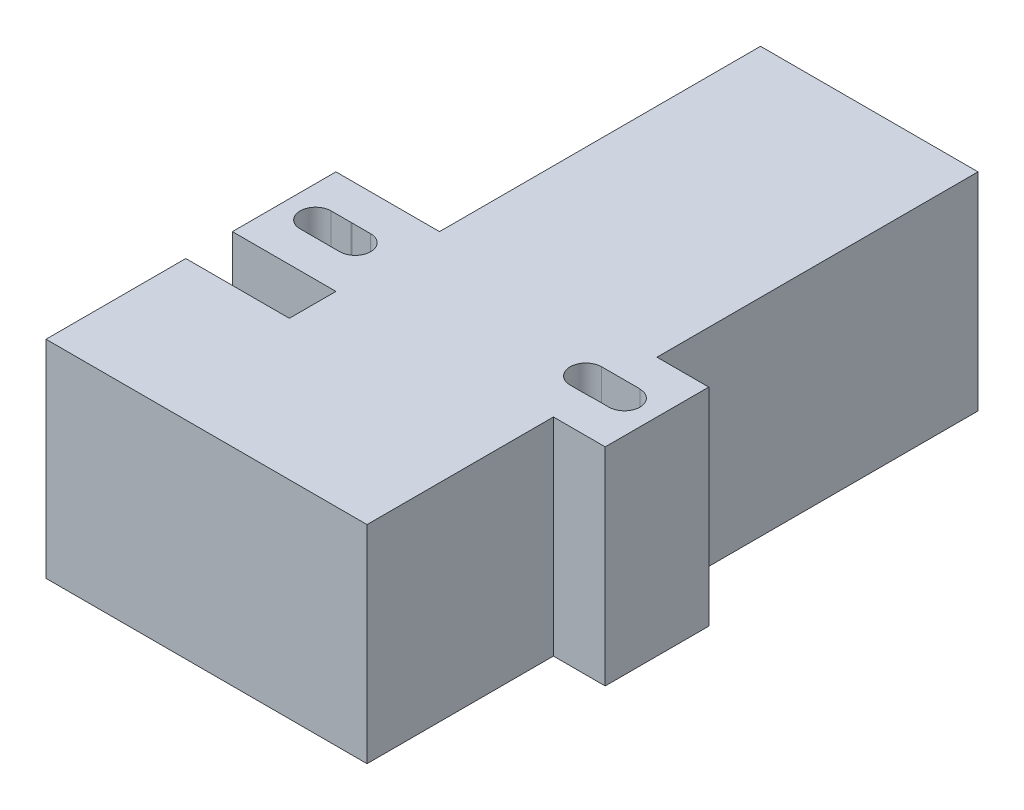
ISO-10303-21;
HEADER;
FILE_DESCRIPTION(('STEP AP214'),'2;1');
FILE_NAME('part.step','',(''),(''),'','','');
FILE_SCHEMA(('AUTOMOTIVE_DESIGN { 1 0 10303 214 1 1 1 1 }'));
ENDSEC;
DATA;
#1=APPLICATION_CONTEXT('core data for automotive mechanical design processes');
#2=APPLICATION_PROTOCOL_DEFINITION('international standard','automotive_design',2000,#1);
#3=PRODUCT_CONTEXT('',#1,'mechanical');
#4=PRODUCT('Part','Part','',(#3));
#5=PRODUCT_RELATED_PRODUCT_CATEGORY('part','',(#4));
#6=PRODUCT_DEFINITION_FORMATION('','',#4);
#7=PRODUCT_DEFINITION_CONTEXT('part definition',#1,'design');
#8=PRODUCT_DEFINITION('design','',#6,#7);
#9=PRODUCT_DEFINITION_SHAPE('','',#8);
#10=(LENGTH_UNIT() NAMED_UNIT(*) SI_UNIT(.MILLI.,.METRE.));
#11=(NAMED_UNIT(*) PLANE_ANGLE_UNIT() SI_UNIT($,.RADIAN.));
#12=(NAMED_UNIT(*) SI_UNIT($,.STERADIAN.) SOLID_ANGLE_UNIT());
#13=UNCERTAINTY_MEASURE_WITH_UNIT(LENGTH_MEASURE(1.E-05),#10,'distance_accuracy_value','');
#14=(GEOMETRIC_REPRESENTATION_CONTEXT(3) GLOBAL_UNCERTAINTY_ASSIGNED_CONTEXT((#13)) GLOBAL_UNIT_ASSIGNED_CONTEXT((#10,
#11,#12)) REPRESENTATION_CONTEXT('',''));
#15=CARTESIAN_POINT('',(0.,0.,0.));
#16=DIRECTION('',(0.,0.,1.));
#17=DIRECTION('',(1.,0.,0.));
#18=AXIS2_PLACEMENT_3D('',#15,#16,#17);
#19=CARTESIAN_POINT('',(0.,20.,0.));
#20=DIRECTION('',(0.,-1.,0.));
#21=DIRECTION('',(0.,0.,-1.));
#22=AXIS2_PLACEMENT_3D('',#19,#20,#21);
#23=PLANE('',#22);
#24=DIRECTION('',(1.,0.,0.));
#25=VECTOR('',#24,1.);
#26=CARTESIAN_POINT('',(0.,20.,-18.));
#27=LINE('',#26,#25);
#28=CARTESIAN_POINT('',(21.,20.,-18.));
#29=VERTEX_POINT('',#28);
#30=CARTESIAN_POINT('',(26.,20.,-18.));
#31=VERTEX_POINT('',#30);
#32=EDGE_CURVE('E257',#29,#31,#27,.T.);
#33=ORIENTED_EDGE('',*,*,#32,.T.);
#34=DIRECTION('',(0.,0.,1.));
#35=VECTOR('',#34,1.);
#36=CARTESIAN_POINT('',(26.,20.,-18.));
#37=LINE('',#36,#35);
#38=CARTESIAN_POINT('',(26.,20.,-28.));
#39=VERTEX_POINT('',#38);
#40=EDGE_CURVE('E465',#39,#31,#37,.T.);
#41=ORIENTED_EDGE('',*,*,#40,.F.);
#42=DIRECTION('',(1.,0.,0.));
#43=VECTOR('',#42,1.);
#44=CARTESIAN_POINT('',(0.,20.,-28.));
#45=LINE('',#44,#43);
#46=CARTESIAN_POINT('',(21.,20.,-28.));
#47=VERTEX_POINT('',#46);
#48=EDGE_CURVE('E418',#47,#39,#45,.T.);
#49=ORIENTED_EDGE('',*,*,#48,.F.);
#50=DIRECTION('',(0.,0.,-1.));
#51=VECTOR('',#50,1.);
#52=CARTESIAN_POINT('',(21.,20.,0.));
#53=LINE('',#52,#51);
#54=CARTESIAN_POINT('',(21.,20.,-59.));
#55=VERTEX_POINT('',#54);
#56=EDGE_CURVE('E406',#47,#55,#53,.T.);
#57=ORIENTED_EDGE('',*,*,#56,.T.);
#58=DIRECTION('',(-1.,0.,0.));
#59=VECTOR('',#58,1.);
#60=CARTESIAN_POINT('',(0.,20.,-59.));
#61=LINE('',#60,#59);
#62=CARTESIAN_POINT('',(0.,20.,-59.));
#63=VERTEX_POINT('',#62);
#64=EDGE_CURVE('E403',#55,#63,#61,.T.);
#65=ORIENTED_EDGE('',*,*,#64,.T.);
#66=DIRECTION('',(0.,0.,1.));
#67=VECTOR('',#66,1.);
#68=CARTESIAN_POINT('',(0.,20.,0.));
#69=LINE('',#68,#67);
#70=CARTESIAN_POINT('',(0.,20.,-28.));
#71=VERTEX_POINT('',#70);
#72=EDGE_CURVE('E405',#63,#71,#69,.T.);
#73=ORIENTED_EDGE('',*,*,#72,.T.);
#74=DIRECTION('',(1.,0.,0.));
#75=VECTOR('',#74,1.);
#76=CARTESIAN_POINT('',(0.,20.,-28.));
#77=LINE('',#76,#75);
#78=CARTESIAN_POINT('',(-10.,20.,-28.));
#79=VERTEX_POINT('',#78);
#80=EDGE_CURVE('E417',#79,#71,#77,.T.);
#81=ORIENTED_EDGE('',*,*,#80,.F.);
#82=DIRECTION('',(0.,0.,1.));
#83=VECTOR('',#82,1.);
#84=CARTESIAN_POINT('',(-10.,20.,-28.));
#85=LINE('',#84,#83);
#86=CARTESIAN_POINT('',(-10.,20.,-18.));
#87=VERTEX_POINT('',#86);
#88=EDGE_CURVE('E413',#79,#87,#85,.T.);
#89=ORIENTED_EDGE('',*,*,#88,.T.);
#90=DIRECTION('',(1.,0.,0.));
#91=VECTOR('',#90,1.);
#92=CARTESIAN_POINT('',(0.,20.,-18.));
#93=LINE('',#92,#91);
#94=CARTESIAN_POINT('',(0.,20.,-18.));
#95=VERTEX_POINT('',#94);
#96=EDGE_CURVE('E434',#87,#95,#93,.T.);
#97=ORIENTED_EDGE('',*,*,#96,.T.);
#98=CARTESIAN_POINT('',(0.,20.,-13.5));
#99=VERTEX_POINT('',#98);
#100=EDGE_CURVE('E414',#95,#99,#69,.T.);
#101=ORIENTED_EDGE('',*,*,#100,.T.);
#102=DIRECTION('',(-1.,0.,0.));
#103=VECTOR('',#102,1.);
#104=CARTESIAN_POINT('',(21.,20.,-13.5));
#105=LINE('',#104,#103);
#106=CARTESIAN_POINT('',(-10.,20.,-13.5));
#107=VERTEX_POINT('',#106);
#108=EDGE_CURVE('E455',#99,#107,#105,.T.);
#109=ORIENTED_EDGE('',*,*,#108,.T.);
#110=DIRECTION('',(0.,0.,1.));
#111=VECTOR('',#110,1.);
#112=CARTESIAN_POINT('',(-10.,20.,0.));
#113=LINE('',#112,#111);
#114=CARTESIAN_POINT('',(-10.,20.,0.));
#115=VERTEX_POINT('',#114);
#116=EDGE_CURVE('E410',#107,#115,#113,.T.);
#117=ORIENTED_EDGE('',*,*,#116,.T.);
#118=DIRECTION('',(1.,0.,0.));
#119=VECTOR('',#118,1.);
#120=CARTESIAN_POINT('',(0.,20.,0.));
#121=LINE('',#120,#119);
#122=CARTESIAN_POINT('',(21.,20.,0.));
#123=VERTEX_POINT('',#122);
#124=EDGE_CURVE('E408',#115,#123,#121,.T.);
#125=ORIENTED_EDGE('',*,*,#124,.T.);
#126=EDGE_CURVE('E333',#123,#29,#53,.T.);
#127=ORIENTED_EDGE('',*,*,#126,.T.);
#128=EDGE_LOOP('',(#33,#41,#49,#57,#65,#73,#81,#89,#97,#101,#109,#117,#125,#127));
#129=FACE_BOUND('',#128,.T.);
#130=CARTESIAN_POINT('',(-3.14042859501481,20.,-23.));
#131=DIRECTION('',(0.,1.,0.));
#132=DIRECTION('',(0.,0.,1.));
#133=AXIS2_PLACEMENT_3D('',#130,#131,#132);
#134=CIRCLE('',#133,1.499718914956);
#135=CARTESIAN_POINT('',(-3.14042859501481,20.,-21.500281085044));
#136=VERTEX_POINT('',#135);
#137=CARTESIAN_POINT('',(-3.14042859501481,20.,-24.499718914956));
#138=VERTEX_POINT('',#137);
#139=EDGE_CURVE('E357',#136,#138,#134,.T.);
#140=ORIENTED_EDGE('',*,*,#139,.F.);
#141=DIRECTION('',(1.,0.,0.));
#142=VECTOR('',#141,1.);
#143=CARTESIAN_POINT('',(-5.,20.,-21.500281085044));
#144=LINE('',#143,#142);
#145=CARTESIAN_POINT('',(-4.97096250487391,20.,-21.500281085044));
#146=VERTEX_POINT('',#145);
#147=EDGE_CURVE('E318',#146,#136,#144,.T.);
#148=ORIENTED_EDGE('',*,*,#147,.F.);
#149=CARTESIAN_POINT('',(-5.,20.,-23.));
#150=DIRECTION('',(0.,1.,0.));
#151=DIRECTION('',(0.,0.,1.));
#152=AXIS2_PLACEMENT_3D('',#149,#150,#151);
#153=CIRCLE('',#152,1.5);
#154=CARTESIAN_POINT('',(-5.0290374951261,20.,-21.500281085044));
#155=VERTEX_POINT('',#154);
#156=EDGE_CURVE('E288',#155,#146,#153,.T.);
#157=ORIENTED_EDGE('',*,*,#156,.F.);
#158=DIRECTION('',(-1.,0.,0.));
#159=VECTOR('',#158,1.);
#160=CARTESIAN_POINT('',(0.,20.,-21.500281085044));
#161=LINE('',#160,#159);
#162=CARTESIAN_POINT('',(-6.96513960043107,20.,-21.500281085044));
#163=VERTEX_POINT('',#162);
#164=EDGE_CURVE('E330',#155,#163,#161,.T.);
#165=ORIENTED_EDGE('',*,*,#164,.T.);
#166=CARTESIAN_POINT('',(-6.96513960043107,20.,-23.));
#167=DIRECTION('',(0.,1.,0.));
#168=DIRECTION('',(0.,0.,1.));
#169=AXIS2_PLACEMENT_3D('',#166,#167,#168);
#170=CIRCLE('',#169,1.499718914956);
#171=CARTESIAN_POINT('',(-6.96513960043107,20.,-24.499718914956));
#172=VERTEX_POINT('',#171);
#173=EDGE_CURVE('E319',#172,#163,#170,.T.);
#174=ORIENTED_EDGE('',*,*,#173,.F.);
#175=DIRECTION('',(-1.,0.,0.));
#176=VECTOR('',#175,1.);
#177=CARTESIAN_POINT('',(0.,20.,-24.499718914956));
#178=LINE('',#177,#176);
#179=CARTESIAN_POINT('',(-5.0290374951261,20.,-24.499718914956));
#180=VERTEX_POINT('',#179);
#181=EDGE_CURVE('E326',#180,#172,#178,.T.);
#182=ORIENTED_EDGE('',*,*,#181,.F.);
#183=CARTESIAN_POINT('',(-4.97096250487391,20.,-24.499718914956));
#184=VERTEX_POINT('',#183);
#185=EDGE_CURVE('E283',#184,#180,#153,.T.);
#186=ORIENTED_EDGE('',*,*,#185,.F.);
#187=DIRECTION('',(1.,0.,0.));
#188=VECTOR('',#187,1.);
#189=CARTESIAN_POINT('',(-5.,20.,-24.499718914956));
#190=LINE('',#189,#188);
#191=EDGE_CURVE('E309',#184,#138,#190,.T.);
#192=ORIENTED_EDGE('',*,*,#191,.T.);
#193=EDGE_LOOP('',(#140,#148,#157,#165,#174,#182,#186,#192));
#194=FACE_BOUND('',#193,.T.);
#195=DIRECTION('',(-1.,0.,0.));
#196=VECTOR('',#195,1.);
#197=CARTESIAN_POINT('',(0.,20.,-24.5264940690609));
#198=LINE('',#197,#196);
#199=CARTESIAN_POINT('',(22.8582460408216,20.,-24.5264940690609));
#200=VERTEX_POINT('',#199);
#201=CARTESIAN_POINT('',(19.1364996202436,20.,-24.5264940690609));
#202=VERTEX_POINT('',#201);
#203=EDGE_CURVE('E297',#200,#202,#198,.T.);
#204=ORIENTED_EDGE('',*,*,#203,.F.);
#205=DIRECTION('',(0.,0.,-1.));
#206=VECTOR('',#205,1.);
#207=CARTESIAN_POINT('',(22.8582460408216,20.,-21.500281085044));
#208=LINE('',#207,#206);
#209=CARTESIAN_POINT('',(22.8582460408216,20.,-24.499718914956));
#210=VERTEX_POINT('',#209);
#211=EDGE_CURVE('E372',#210,#200,#208,.T.);
#212=ORIENTED_EDGE('',*,*,#211,.F.);
#213=CARTESIAN_POINT('',(22.8582460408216,20.,-23.));
#214=DIRECTION('',(0.,1.,0.));
#215=DIRECTION('',(0.,0.,1.));
#216=AXIS2_PLACEMENT_3D('',#213,#214,#215);
#217=CIRCLE('',#216,1.499718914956);
#218=CARTESIAN_POINT('',(22.8582460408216,20.,-21.500281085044));
#219=VERTEX_POINT('',#218);
#220=EDGE_CURVE('E266',#219,#210,#217,.T.);
#221=ORIENTED_EDGE('',*,*,#220,.F.);
#222=DIRECTION('',(1.,0.,0.));
#223=VECTOR('',#222,1.);
#224=CARTESIAN_POINT('',(0.,20.,-21.500281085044));
#225=LINE('',#224,#223);
#226=CARTESIAN_POINT('',(21.284652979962,20.,-21.500281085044));
#227=VERTEX_POINT('',#226);
#228=EDGE_CURVE('E75',#227,#219,#225,.T.);
#229=ORIENTED_EDGE('',*,*,#228,.F.);
#230=CARTESIAN_POINT('',(21.,20.,-23.));
#231=DIRECTION('',(0.,1.,0.));
#232=DIRECTION('',(0.,0.,1.));
#233=AXIS2_PLACEMENT_3D('',#230,#231,#232);
#234=CIRCLE('',#233,1.52649406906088);
#235=CARTESIAN_POINT('',(21.,20.,-21.4735059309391));
#236=VERTEX_POINT('',#235);
#237=EDGE_CURVE('E299',#236,#227,#234,.T.);
#238=ORIENTED_EDGE('',*,*,#237,.F.);
#239=DIRECTION('',(-1.,0.,0.));
#240=VECTOR('',#239,1.);
#241=CARTESIAN_POINT('',(0.,20.,-21.4735059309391));
#242=LINE('',#241,#240);
#243=CARTESIAN_POINT('',(19.1364996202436,20.,-21.4735059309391));
#244=VERTEX_POINT('',#243);
#245=EDGE_CURVE('E305',#236,#244,#242,.T.);
#246=ORIENTED_EDGE('',*,*,#245,.T.);
#247=CARTESIAN_POINT('',(19.1364996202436,20.,-23.));
#248=DIRECTION('',(0.,1.,0.));
#249=DIRECTION('',(0.,0.,1.));
#250=AXIS2_PLACEMENT_3D('',#247,#248,#249);
#251=CIRCLE('',#250,1.52649406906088);
#252=EDGE_CURVE('E301',#202,#244,#251,.T.);
#253=ORIENTED_EDGE('',*,*,#252,.F.);
#254=EDGE_LOOP('',(#204,#212,#221,#229,#238,#246,#253));
#255=FACE_BOUND('',#254,.T.);
#256=ADVANCED_FACE('F67',(#129,#194,#255),#23,.F.);
#257=CARTESIAN_POINT('',(0.,0.,0.));
#258=DIRECTION('',(0.,-1.,0.));
#259=DIRECTION('',(0.,0.,-1.));
#260=AXIS2_PLACEMENT_3D('',#257,#258,#259);
#261=PLANE('',#260);
#262=DIRECTION('',(0.,0.,1.));
#263=VECTOR('',#262,1.);
#264=CARTESIAN_POINT('',(22.8582460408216,0.,0.));
#265=LINE('',#264,#263);
#266=CARTESIAN_POINT('',(22.8582460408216,0.,-24.5264940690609));
#267=VERTEX_POINT('',#266);
#268=CARTESIAN_POINT('',(22.8582460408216,0.,-24.499718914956));
#269=VERTEX_POINT('',#268);
#270=EDGE_CURVE('E246',#267,#269,#265,.T.);
#271=ORIENTED_EDGE('',*,*,#270,.F.);
#272=DIRECTION('',(-1.,0.,0.));
#273=VECTOR('',#272,1.);
#274=CARTESIAN_POINT('',(0.,0.,-24.5264940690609));
#275=LINE('',#274,#273);
#276=CARTESIAN_POINT('',(19.1364996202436,0.,-24.5264940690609));
#277=VERTEX_POINT('',#276);
#278=EDGE_CURVE('E273',#267,#277,#275,.T.);
#279=ORIENTED_EDGE('',*,*,#278,.T.);
#280=CARTESIAN_POINT('',(19.1364996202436,0.,-23.));
#281=DIRECTION('',(0.,1.,0.));
#282=DIRECTION('',(0.,0.,1.));
#283=AXIS2_PLACEMENT_3D('',#280,#281,#282);
#284=CIRCLE('',#283,1.52649406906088);
#285=CARTESIAN_POINT('',(19.1364996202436,0.,-21.4735059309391));
#286=VERTEX_POINT('',#285);
#287=EDGE_CURVE('E276',#277,#286,#284,.T.);
#288=ORIENTED_EDGE('',*,*,#287,.T.);
#289=DIRECTION('',(-1.,0.,0.));
#290=VECTOR('',#289,1.);
#291=CARTESIAN_POINT('',(0.,0.,-21.4735059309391));
#292=LINE('',#291,#290);
#293=CARTESIAN_POINT('',(21.,0.,-21.4735059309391));
#294=VERTEX_POINT('',#293);
#295=EDGE_CURVE('E296',#294,#286,#292,.T.);
#296=ORIENTED_EDGE('',*,*,#295,.F.);
#297=CARTESIAN_POINT('',(21.,0.,-23.));
#298=DIRECTION('',(0.,1.,0.));
#299=DIRECTION('',(0.,0.,1.));
#300=AXIS2_PLACEMENT_3D('',#297,#298,#299);
#301=CIRCLE('',#300,1.52649406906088);
#302=CARTESIAN_POINT('',(21.284652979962,0.,-21.500281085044));
#303=VERTEX_POINT('',#302);
#304=EDGE_CURVE('E284',#294,#303,#301,.T.);
#305=ORIENTED_EDGE('',*,*,#304,.T.);
#306=DIRECTION('',(1.,0.,0.));
#307=VECTOR('',#306,1.);
#308=CARTESIAN_POINT('',(0.,0.,-21.500281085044));
#309=LINE('',#308,#307);
#310=CARTESIAN_POINT('',(22.8582460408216,0.,-21.500281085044));
#311=VERTEX_POINT('',#310);
#312=EDGE_CURVE('E272',#303,#311,#309,.T.);
#313=ORIENTED_EDGE('',*,*,#312,.T.);
#314=CARTESIAN_POINT('',(22.8582460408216,0.,-23.));
#315=DIRECTION('',(0.,1.,0.));
#316=DIRECTION('',(0.,0.,1.));
#317=AXIS2_PLACEMENT_3D('',#314,#315,#316);
#318=CIRCLE('',#317,1.499718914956);
#319=EDGE_CURVE('E263',#311,#269,#318,.T.);
#320=ORIENTED_EDGE('',*,*,#319,.T.);
#321=EDGE_LOOP('',(#271,#279,#288,#296,#305,#313,#320));
#322=FACE_BOUND('',#321,.T.);
#323=DIRECTION('',(1.,0.,0.));
#324=VECTOR('',#323,1.);
#325=CARTESIAN_POINT('',(-5.,0.,-21.500281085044));
#326=LINE('',#325,#324);
#327=CARTESIAN_POINT('',(-4.97096250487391,0.,-21.500281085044));
#328=VERTEX_POINT('',#327);
#329=CARTESIAN_POINT('',(-3.14042859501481,0.,-21.500281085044));
#330=VERTEX_POINT('',#329);
#331=EDGE_CURVE('E308',#328,#330,#326,.T.);
#332=ORIENTED_EDGE('',*,*,#331,.T.);
#333=CARTESIAN_POINT('',(-3.14042859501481,0.,-23.));
#334=DIRECTION('',(0.,1.,0.));
#335=DIRECTION('',(0.,0.,1.));
#336=AXIS2_PLACEMENT_3D('',#333,#334,#335);
#337=CIRCLE('',#336,1.499718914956);
#338=CARTESIAN_POINT('',(-3.14042859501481,0.,-24.499718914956));
#339=VERTEX_POINT('',#338);
#340=EDGE_CURVE('E349',#330,#339,#337,.T.);
#341=ORIENTED_EDGE('',*,*,#340,.T.);
#342=DIRECTION('',(1.,0.,0.));
#343=VECTOR('',#342,1.);
#344=CARTESIAN_POINT('',(-5.,0.,-24.499718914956));
#345=LINE('',#344,#343);
#346=CARTESIAN_POINT('',(-4.97096250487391,0.,-24.499718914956));
#347=VERTEX_POINT('',#346);
#348=EDGE_CURVE('E352',#347,#339,#345,.T.);
#349=ORIENTED_EDGE('',*,*,#348,.F.);
#350=CARTESIAN_POINT('',(-5.,0.,-23.));
#351=DIRECTION('',(0.,1.,0.));
#352=DIRECTION('',(0.,0.,1.));
#353=AXIS2_PLACEMENT_3D('',#350,#351,#352);
#354=CIRCLE('',#353,1.5);
#355=CARTESIAN_POINT('',(-5.0290374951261,0.,-24.499718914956));
#356=VERTEX_POINT('',#355);
#357=EDGE_CURVE('E346',#347,#356,#354,.T.);
#358=ORIENTED_EDGE('',*,*,#357,.T.);
#359=DIRECTION('',(-1.,0.,0.));
#360=VECTOR('',#359,1.);
#361=CARTESIAN_POINT('',(0.,0.,-24.499718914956));
#362=LINE('',#361,#360);
#363=CARTESIAN_POINT('',(-6.96513960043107,0.,-24.499718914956));
#364=VERTEX_POINT('',#363);
#365=EDGE_CURVE('E343',#356,#364,#362,.T.);
#366=ORIENTED_EDGE('',*,*,#365,.T.);
#367=CARTESIAN_POINT('',(-6.96513960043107,0.,-23.));
#368=DIRECTION('',(0.,1.,0.));
#369=DIRECTION('',(0.,0.,1.));
#370=AXIS2_PLACEMENT_3D('',#367,#368,#369);
#371=CIRCLE('',#370,1.499718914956);
#372=CARTESIAN_POINT('',(-6.96513960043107,0.,-21.500281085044));
#373=VERTEX_POINT('',#372);
#374=EDGE_CURVE('E339',#364,#373,#371,.T.);
#375=ORIENTED_EDGE('',*,*,#374,.T.);
#376=DIRECTION('',(-1.,0.,0.));
#377=VECTOR('',#376,1.);
#378=CARTESIAN_POINT('',(0.,0.,-21.500281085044));
#379=LINE('',#378,#377);
#380=CARTESIAN_POINT('',(-5.0290374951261,0.,-21.500281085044));
#381=VERTEX_POINT('',#380);
#382=EDGE_CURVE('E322',#381,#373,#379,.T.);
#383=ORIENTED_EDGE('',*,*,#382,.F.);
#384=EDGE_CURVE('E342',#381,#328,#354,.T.);
#385=ORIENTED_EDGE('',*,*,#384,.T.);
#386=EDGE_LOOP('',(#332,#341,#349,#358,#366,#375,#383,#385));
#387=FACE_BOUND('',#386,.T.);
#388=DIRECTION('',(0.,0.,1.));
#389=VECTOR('',#388,1.);
#390=CARTESIAN_POINT('',(26.,0.,-18.));
#391=LINE('',#390,#389);
#392=CARTESIAN_POINT('',(26.,0.,-28.));
#393=VERTEX_POINT('',#392);
#394=CARTESIAN_POINT('',(26.,0.,-18.));
#395=VERTEX_POINT('',#394);
#396=EDGE_CURVE('E441',#393,#395,#391,.T.);
#397=ORIENTED_EDGE('',*,*,#396,.T.);
#398=DIRECTION('',(1.,0.,0.));
#399=VECTOR('',#398,1.);
#400=CARTESIAN_POINT('',(0.,0.,-18.));
#401=LINE('',#400,#399);
#402=CARTESIAN_POINT('',(21.,0.,-18.));
#403=VERTEX_POINT('',#402);
#404=EDGE_CURVE('E423',#403,#395,#401,.T.);
#405=ORIENTED_EDGE('',*,*,#404,.F.);
#406=DIRECTION('',(0.,0.,-1.));
#407=VECTOR('',#406,1.);
#408=CARTESIAN_POINT('',(21.,0.,0.));
#409=LINE('',#408,#407);
#410=CARTESIAN_POINT('',(21.,0.,0.));
#411=VERTEX_POINT('',#410);
#412=EDGE_CURVE('E384',#411,#403,#409,.T.);
#413=ORIENTED_EDGE('',*,*,#412,.F.);
#414=DIRECTION('',(1.,0.,0.));
#415=VECTOR('',#414,1.);
#416=CARTESIAN_POINT('',(0.,0.,0.));
#417=LINE('',#416,#415);
#418=CARTESIAN_POINT('',(-10.,0.,0.));
#419=VERTEX_POINT('',#418);
#420=EDGE_CURVE('E394',#419,#411,#417,.T.);
#421=ORIENTED_EDGE('',*,*,#420,.F.);
#422=DIRECTION('',(0.,0.,1.));
#423=VECTOR('',#422,1.);
#424=CARTESIAN_POINT('',(-10.,0.,0.));
#425=LINE('',#424,#423);
#426=CARTESIAN_POINT('',(-10.,0.,-13.5));
#427=VERTEX_POINT('',#426);
#428=EDGE_CURVE('E448',#427,#419,#425,.T.);
#429=ORIENTED_EDGE('',*,*,#428,.F.);
#430=DIRECTION('',(-1.,0.,0.));
#431=VECTOR('',#430,1.);
#432=CARTESIAN_POINT('',(21.,0.,-13.5));
#433=LINE('',#432,#431);
#434=CARTESIAN_POINT('',(0.,0.,-13.5));
#435=VERTEX_POINT('',#434);
#436=EDGE_CURVE('E430',#435,#427,#433,.T.);
#437=ORIENTED_EDGE('',*,*,#436,.F.);
#438=DIRECTION('',(0.,0.,1.));
#439=VECTOR('',#438,1.);
#440=CARTESIAN_POINT('',(0.,0.,0.));
#441=LINE('',#440,#439);
#442=CARTESIAN_POINT('',(0.,0.,-18.));
#443=VERTEX_POINT('',#442);
#444=EDGE_CURVE('E286',#443,#435,#441,.T.);
#445=ORIENTED_EDGE('',*,*,#444,.F.);
#446=DIRECTION('',(1.,0.,0.));
#447=VECTOR('',#446,1.);
#448=CARTESIAN_POINT('',(0.,0.,-18.));
#449=LINE('',#448,#447);
#450=CARTESIAN_POINT('',(-10.,0.,-18.));
#451=VERTEX_POINT('',#450);
#452=EDGE_CURVE('E431',#451,#443,#449,.T.);
#453=ORIENTED_EDGE('',*,*,#452,.F.);
#454=DIRECTION('',(0.,0.,1.));
#455=VECTOR('',#454,1.);
#456=CARTESIAN_POINT('',(-10.,0.,-28.));
#457=LINE('',#456,#455);
#458=CARTESIAN_POINT('',(-10.,0.,-28.));
#459=VERTEX_POINT('',#458);
#460=EDGE_CURVE('E452',#459,#451,#457,.T.);
#461=ORIENTED_EDGE('',*,*,#460,.F.);
#462=DIRECTION('',(1.,0.,0.));
#463=VECTOR('',#462,1.);
#464=CARTESIAN_POINT('',(0.,0.,-28.));
#465=LINE('',#464,#463);
#466=CARTESIAN_POINT('',(0.,0.,-28.));
#467=VERTEX_POINT('',#466);
#468=EDGE_CURVE('E279',#459,#467,#465,.T.);
#469=ORIENTED_EDGE('',*,*,#468,.T.);
#470=CARTESIAN_POINT('',(0.,0.,-59.));
#471=VERTEX_POINT('',#470);
#472=EDGE_CURVE('E400',#471,#467,#441,.T.);
#473=ORIENTED_EDGE('',*,*,#472,.F.);
#474=DIRECTION('',(-1.,0.,0.));
#475=VECTOR('',#474,1.);
#476=CARTESIAN_POINT('',(0.,0.,-59.));
#477=LINE('',#476,#475);
#478=CARTESIAN_POINT('',(21.,0.,-59.));
#479=VERTEX_POINT('',#478);
#480=EDGE_CURVE('E390',#479,#471,#477,.T.);
#481=ORIENTED_EDGE('',*,*,#480,.F.);
#482=CARTESIAN_POINT('',(21.,0.,-28.));
#483=VERTEX_POINT('',#482);
#484=EDGE_CURVE('E398',#483,#479,#409,.T.);
#485=ORIENTED_EDGE('',*,*,#484,.F.);
#486=DIRECTION('',(1.,0.,0.));
#487=VECTOR('',#486,1.);
#488=CARTESIAN_POINT('',(0.,0.,-28.));
#489=LINE('',#488,#487);
#490=EDGE_CURVE('E274',#483,#393,#489,.T.);
#491=ORIENTED_EDGE('',*,*,#490,.T.);
#492=EDGE_LOOP('',(#397,#405,#413,#421,#429,#437,#445,#453,#461,#469,#473,#481,#485,#491));
#493=FACE_BOUND('',#492,.T.);
#494=ADVANCED_FACE('F269',(#322,#387,#493),#261,.T.);
#495=CARTESIAN_POINT('',(-5.,0.,-23.));
#496=DIRECTION('',(0.,1.,0.));
#497=DIRECTION('',(0.,0.,1.));
#498=AXIS2_PLACEMENT_3D('',#495,#496,#497);
#499=CYLINDRICAL_SURFACE('',#498,1.5);
#500=DIRECTION('',(0.,1.,0.));
#501=VECTOR('',#500,1.);
#502=CARTESIAN_POINT('',(-4.97096250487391,0.,-24.499718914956));
#503=LINE('',#502,#501);
#504=EDGE_CURVE('E355',#184,#347,#503,.F.);
#505=ORIENTED_EDGE('',*,*,#504,.F.);
#506=ORIENTED_EDGE('',*,*,#185,.T.);
#507=DIRECTION('',(0.,1.,0.));
#508=VECTOR('',#507,1.);
#509=CARTESIAN_POINT('',(-5.0290374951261,0.,-24.499718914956));
#510=LINE('',#509,#508);
#511=EDGE_CURVE('E328',#356,#180,#510,.T.);
#512=ORIENTED_EDGE('',*,*,#511,.F.);
#513=ORIENTED_EDGE('',*,*,#357,.F.);
#514=EDGE_LOOP('',(#505,#506,#512,#513));
#515=FACE_BOUND('',#514,.T.);
#516=ADVANCED_FACE('F488',(#515),#499,.F.);
#517=CARTESIAN_POINT('',(0.,20.,0.));
#518=DIRECTION('',(1.,0.,0.));
#519=DIRECTION('',(0.,0.,-1.));
#520=AXIS2_PLACEMENT_3D('',#517,#518,#519);
#521=PLANE('',#520);
#522=ORIENTED_EDGE('',*,*,#444,.T.);
#523=DIRECTION('',(0.,1.,0.));
#524=VECTOR('',#523,1.);
#525=CARTESIAN_POINT('',(0.,20.,-13.5));
#526=LINE('',#525,#524);
#527=EDGE_CURVE('E442',#435,#99,#526,.T.);
#528=ORIENTED_EDGE('',*,*,#527,.T.);
#529=ORIENTED_EDGE('',*,*,#100,.F.);
#530=DIRECTION('',(0.,1.,0.));
#531=VECTOR('',#530,1.);
#532=CARTESIAN_POINT('',(0.,0.,-18.));
#533=LINE('',#532,#531);
#534=EDGE_CURVE('E428',#443,#95,#533,.T.);
#535=ORIENTED_EDGE('',*,*,#534,.F.);
#536=EDGE_LOOP('',(#522,#528,#529,#535));
#537=FACE_BOUND('',#536,.T.);
#538=ADVANCED_FACE('F579',(#537),#521,.F.);
#539=CARTESIAN_POINT('',(21.,20.,0.));
#540=DIRECTION('',(-1.,0.,0.));
#541=DIRECTION('',(0.,0.,1.));
#542=AXIS2_PLACEMENT_3D('',#539,#540,#541);
#543=PLANE('',#542);
#544=DIRECTION('',(0.,1.,0.));
#545=VECTOR('',#544,1.);
#546=CARTESIAN_POINT('',(21.,0.,-28.));
#547=LINE('',#546,#545);
#548=EDGE_CURVE('E415',#483,#47,#547,.T.);
#549=ORIENTED_EDGE('',*,*,#548,.F.);
#550=ORIENTED_EDGE('',*,*,#484,.T.);
#551=DIRECTION('',(0.,-1.,0.));
#552=VECTOR('',#551,1.);
#553=CARTESIAN_POINT('',(21.,20.,-59.));
#554=LINE('',#553,#552);
#555=EDGE_CURVE('E386',#55,#479,#554,.T.);
#556=ORIENTED_EDGE('',*,*,#555,.F.);
#557=ORIENTED_EDGE('',*,*,#56,.F.);
#558=EDGE_LOOP('',(#549,#550,#556,#557));
#559=FACE_BOUND('',#558,.T.);
#560=ADVANCED_FACE('F554',(#559),#543,.F.);
#561=ORIENTED_EDGE('',*,*,#472,.T.);
#562=DIRECTION('',(0.,1.,0.));
#563=VECTOR('',#562,1.);
#564=CARTESIAN_POINT('',(0.,0.,-28.));
#565=LINE('',#564,#563);
#566=EDGE_CURVE('E395',#467,#71,#565,.T.);
#567=ORIENTED_EDGE('',*,*,#566,.T.);
#568=ORIENTED_EDGE('',*,*,#72,.F.);
#569=DIRECTION('',(0.,-1.,0.));
#570=VECTOR('',#569,1.);
#571=CARTESIAN_POINT('',(0.,20.,-59.));
#572=LINE('',#571,#570);
#573=EDGE_CURVE('E391',#63,#471,#572,.T.);
#574=ORIENTED_EDGE('',*,*,#573,.T.);
#575=EDGE_LOOP('',(#561,#567,#568,#574));
#576=FACE_BOUND('',#575,.T.);
#577=ADVANCED_FACE('F562',(#576),#521,.F.);
#578=CARTESIAN_POINT('',(0.,20.,0.));
#579=DIRECTION('',(0.,0.,-1.));
#580=DIRECTION('',(-1.,0.,0.));
#581=AXIS2_PLACEMENT_3D('',#578,#579,#580);
#582=PLANE('',#581);
#583=ORIENTED_EDGE('',*,*,#420,.T.);
#584=DIRECTION('',(0.,-1.,0.));
#585=VECTOR('',#584,1.);
#586=CARTESIAN_POINT('',(21.,20.,0.));
#587=LINE('',#586,#585);
#588=EDGE_CURVE('E381',#123,#411,#587,.T.);
#589=ORIENTED_EDGE('',*,*,#588,.F.);
#590=ORIENTED_EDGE('',*,*,#124,.F.);
#591=DIRECTION('',(0.,1.,0.));
#592=VECTOR('',#591,1.);
#593=CARTESIAN_POINT('',(-10.,0.,0.));
#594=LINE('',#593,#592);
#595=EDGE_CURVE('E449',#419,#115,#594,.T.);
#596=ORIENTED_EDGE('',*,*,#595,.F.);
#597=EDGE_LOOP('',(#583,#589,#590,#596));
#598=FACE_BOUND('',#597,.T.);
#599=ADVANCED_FACE('F589',(#598),#582,.F.);
#600=DIRECTION('',(0.,1.,0.));
#601=VECTOR('',#600,1.);
#602=CARTESIAN_POINT('',(21.,0.,-18.));
#603=LINE('',#602,#601);
#604=EDGE_CURVE('E385',#403,#29,#603,.T.);
#605=ORIENTED_EDGE('',*,*,#604,.T.);
#606=ORIENTED_EDGE('',*,*,#126,.F.);
#607=ORIENTED_EDGE('',*,*,#588,.T.);
#608=ORIENTED_EDGE('',*,*,#412,.T.);
#609=EDGE_LOOP('',(#605,#606,#607,#608));
#610=FACE_BOUND('',#609,.T.);
#611=ADVANCED_FACE('F539',(#610),#543,.F.);
#612=CARTESIAN_POINT('',(0.,20.,-59.));
#613=DIRECTION('',(0.,0.,1.));
#614=DIRECTION('',(1.,0.,0.));
#615=AXIS2_PLACEMENT_3D('',#612,#613,#614);
#616=PLANE('',#615);
#617=ORIENTED_EDGE('',*,*,#480,.T.);
#618=ORIENTED_EDGE('',*,*,#573,.F.);
#619=ORIENTED_EDGE('',*,*,#64,.F.);
#620=ORIENTED_EDGE('',*,*,#555,.T.);
#621=EDGE_LOOP('',(#617,#618,#619,#620));
#622=FACE_BOUND('',#621,.T.);
#623=ADVANCED_FACE('F559',(#622),#616,.F.);
#624=CARTESIAN_POINT('',(0.,0.,-18.));
#625=DIRECTION('',(0.,0.,1.));
#626=DIRECTION('',(1.,0.,0.));
#627=AXIS2_PLACEMENT_3D('',#624,#625,#626);
#628=PLANE('',#627);
#629=DIRECTION('',(0.,1.,0.));
#630=VECTOR('',#629,1.);
#631=CARTESIAN_POINT('',(26.,0.,-18.));
#632=LINE('',#631,#630);
#633=EDGE_CURVE('E389',#395,#31,#632,.T.);
#634=ORIENTED_EDGE('',*,*,#633,.T.);
#635=ORIENTED_EDGE('',*,*,#32,.F.);
#636=ORIENTED_EDGE('',*,*,#604,.F.);
#637=ORIENTED_EDGE('',*,*,#404,.T.);
#638=EDGE_LOOP('',(#634,#635,#636,#637));
#639=FACE_BOUND('',#638,.T.);
#640=ADVANCED_FACE('F536',(#639),#628,.T.);
#641=CARTESIAN_POINT('',(0.,0.,-28.));
#642=DIRECTION('',(0.,0.,1.));
#643=DIRECTION('',(1.,0.,0.));
#644=AXIS2_PLACEMENT_3D('',#641,#642,#643);
#645=PLANE('',#644);
#646=ORIENTED_EDGE('',*,*,#48,.T.);
#647=DIRECTION('',(0.,1.,0.));
#648=VECTOR('',#647,1.);
#649=CARTESIAN_POINT('',(26.,0.,-28.));
#650=LINE('',#649,#648);
#651=EDGE_CURVE('E470',#393,#39,#650,.T.);
#652=ORIENTED_EDGE('',*,*,#651,.F.);
#653=ORIENTED_EDGE('',*,*,#490,.F.);
#654=ORIENTED_EDGE('',*,*,#548,.T.);
#655=EDGE_LOOP('',(#646,#652,#653,#654));
#656=FACE_BOUND('',#655,.T.);
#657=ADVANCED_FACE('F549',(#656),#645,.F.);
#658=CARTESIAN_POINT('',(0.,0.,-28.));
#659=DIRECTION('',(0.,0.,1.));
#660=DIRECTION('',(1.,0.,0.));
#661=AXIS2_PLACEMENT_3D('',#658,#659,#660);
#662=PLANE('',#661);
#663=ORIENTED_EDGE('',*,*,#80,.T.);
#664=ORIENTED_EDGE('',*,*,#566,.F.);
#665=ORIENTED_EDGE('',*,*,#468,.F.);
#666=DIRECTION('',(0.,1.,0.));
#667=VECTOR('',#666,1.);
#668=CARTESIAN_POINT('',(-10.,0.,-28.));
#669=LINE('',#668,#667);
#670=EDGE_CURVE('E438',#459,#79,#669,.T.);
#671=ORIENTED_EDGE('',*,*,#670,.T.);
#672=EDGE_LOOP('',(#663,#664,#665,#671));
#673=FACE_BOUND('',#672,.T.);
#674=ADVANCED_FACE('F566',(#673),#662,.F.);
#675=CARTESIAN_POINT('',(0.,0.,-18.));
#676=DIRECTION('',(0.,0.,1.));
#677=DIRECTION('',(1.,0.,0.));
#678=AXIS2_PLACEMENT_3D('',#675,#676,#677);
#679=PLANE('',#678);
#680=ORIENTED_EDGE('',*,*,#96,.F.);
#681=DIRECTION('',(0.,1.,0.));
#682=VECTOR('',#681,1.);
#683=CARTESIAN_POINT('',(-10.,0.,-18.));
#684=LINE('',#683,#682);
#685=EDGE_CURVE('E462',#451,#87,#684,.T.);
#686=ORIENTED_EDGE('',*,*,#685,.F.);
#687=ORIENTED_EDGE('',*,*,#452,.T.);
#688=ORIENTED_EDGE('',*,*,#534,.T.);
#689=EDGE_LOOP('',(#680,#686,#687,#688));
#690=FACE_BOUND('',#689,.T.);
#691=ADVANCED_FACE('F608',(#690),#679,.T.);
#692=CARTESIAN_POINT('',(21.,0.,-13.5));
#693=DIRECTION('',(0.,0.,-1.));
#694=DIRECTION('',(-1.,0.,0.));
#695=AXIS2_PLACEMENT_3D('',#692,#693,#694);
#696=PLANE('',#695);
#697=ORIENTED_EDGE('',*,*,#527,.F.);
#698=ORIENTED_EDGE('',*,*,#436,.T.);
#699=DIRECTION('',(0.,1.,0.));
#700=VECTOR('',#699,1.);
#701=CARTESIAN_POINT('',(-10.,0.,-13.5));
#702=LINE('',#701,#700);
#703=EDGE_CURVE('E445',#427,#107,#702,.T.);
#704=ORIENTED_EDGE('',*,*,#703,.T.);
#705=ORIENTED_EDGE('',*,*,#108,.F.);
#706=EDGE_LOOP('',(#697,#698,#704,#705));
#707=FACE_BOUND('',#706,.T.);
#708=ADVANCED_FACE('F583',(#707),#696,.T.);
#709=CARTESIAN_POINT('',(-10.,0.,0.));
#710=DIRECTION('',(-1.,0.,0.));
#711=DIRECTION('',(0.,0.,1.));
#712=AXIS2_PLACEMENT_3D('',#709,#710,#711);
#713=PLANE('',#712);
#714=ORIENTED_EDGE('',*,*,#116,.F.);
#715=ORIENTED_EDGE('',*,*,#703,.F.);
#716=ORIENTED_EDGE('',*,*,#428,.T.);
#717=ORIENTED_EDGE('',*,*,#595,.T.);
#718=EDGE_LOOP('',(#714,#715,#716,#717));
#719=FACE_BOUND('',#718,.T.);
#720=ADVANCED_FACE('F587',(#719),#713,.T.);
#721=CARTESIAN_POINT('',(-10.,0.,-28.));
#722=DIRECTION('',(-1.,0.,0.));
#723=DIRECTION('',(0.,0.,1.));
#724=AXIS2_PLACEMENT_3D('',#721,#722,#723);
#725=PLANE('',#724);
#726=ORIENTED_EDGE('',*,*,#88,.F.);
#727=ORIENTED_EDGE('',*,*,#670,.F.);
#728=ORIENTED_EDGE('',*,*,#460,.T.);
#729=ORIENTED_EDGE('',*,*,#685,.T.);
#730=EDGE_LOOP('',(#726,#727,#728,#729));
#731=FACE_BOUND('',#730,.T.);
#732=ADVANCED_FACE('F571',(#731),#725,.T.);
#733=CARTESIAN_POINT('',(26.,0.,-18.));
#734=DIRECTION('',(-1.,0.,0.));
#735=DIRECTION('',(0.,0.,1.));
#736=AXIS2_PLACEMENT_3D('',#733,#734,#735);
#737=PLANE('',#736);
#738=ORIENTED_EDGE('',*,*,#40,.T.);
#739=ORIENTED_EDGE('',*,*,#633,.F.);
#740=ORIENTED_EDGE('',*,*,#396,.F.);
#741=ORIENTED_EDGE('',*,*,#651,.T.);
#742=EDGE_LOOP('',(#738,#739,#740,#741));
#743=FACE_BOUND('',#742,.T.);
#744=ADVANCED_FACE('F547',(#743),#737,.F.);
#745=ORIENTED_EDGE('',*,*,#156,.T.);
#746=DIRECTION('',(0.,1.,0.));
#747=VECTOR('',#746,1.);
#748=CARTESIAN_POINT('',(-4.97096250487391,0.,-21.500281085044));
#749=LINE('',#748,#747);
#750=EDGE_CURVE('E327',#146,#328,#749,.F.);
#751=ORIENTED_EDGE('',*,*,#750,.T.);
#752=ORIENTED_EDGE('',*,*,#384,.F.);
#753=DIRECTION('',(0.,1.,0.));
#754=VECTOR('',#753,1.);
#755=CARTESIAN_POINT('',(-5.0290374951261,0.,-21.500281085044));
#756=LINE('',#755,#754);
#757=EDGE_CURVE('E323',#381,#155,#756,.T.);
#758=ORIENTED_EDGE('',*,*,#757,.T.);
#759=EDGE_LOOP('',(#745,#751,#752,#758));
#760=FACE_BOUND('',#759,.T.);
#761=ADVANCED_FACE('F503',(#760),#499,.F.);
#762=CARTESIAN_POINT('',(0.,0.,-24.499718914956));
#763=DIRECTION('',(0.,0.,-1.));
#764=DIRECTION('',(-1.,0.,0.));
#765=AXIS2_PLACEMENT_3D('',#762,#763,#764);
#766=PLANE('',#765);
#767=ORIENTED_EDGE('',*,*,#181,.T.);
#768=DIRECTION('',(0.,1.,0.));
#769=VECTOR('',#768,1.);
#770=CARTESIAN_POINT('',(-6.96513960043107,0.,-24.499718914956));
#771=LINE('',#770,#769);
#772=EDGE_CURVE('E316',#364,#172,#771,.T.);
#773=ORIENTED_EDGE('',*,*,#772,.F.);
#774=ORIENTED_EDGE('',*,*,#365,.F.);
#775=ORIENTED_EDGE('',*,*,#511,.T.);
#776=EDGE_LOOP('',(#767,#773,#774,#775));
#777=FACE_BOUND('',#776,.T.);
#778=ADVANCED_FACE('F492',(#777),#766,.F.);
#779=CARTESIAN_POINT('',(0.,0.,-21.500281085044));
#780=DIRECTION('',(0.,0.,-1.));
#781=DIRECTION('',(-1.,0.,0.));
#782=AXIS2_PLACEMENT_3D('',#779,#780,#781);
#783=PLANE('',#782);
#784=ORIENTED_EDGE('',*,*,#164,.F.);
#785=ORIENTED_EDGE('',*,*,#757,.F.);
#786=ORIENTED_EDGE('',*,*,#382,.T.);
#787=DIRECTION('',(0.,1.,0.));
#788=VECTOR('',#787,1.);
#789=CARTESIAN_POINT('',(-6.96513960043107,0.,-21.500281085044));
#790=LINE('',#789,#788);
#791=EDGE_CURVE('E320',#373,#163,#790,.T.);
#792=ORIENTED_EDGE('',*,*,#791,.T.);
#793=EDGE_LOOP('',(#784,#785,#786,#792));
#794=FACE_BOUND('',#793,.T.);
#795=ADVANCED_FACE('F637',(#794),#783,.T.);
#796=CARTESIAN_POINT('',(-6.96513960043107,0.,-23.));
#797=DIRECTION('',(0.,1.,0.));
#798=DIRECTION('',(0.,0.,1.));
#799=AXIS2_PLACEMENT_3D('',#796,#797,#798);
#800=CYLINDRICAL_SURFACE('',#799,1.499718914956);
#801=ORIENTED_EDGE('',*,*,#173,.T.);
#802=ORIENTED_EDGE('',*,*,#791,.F.);
#803=ORIENTED_EDGE('',*,*,#374,.F.);
#804=ORIENTED_EDGE('',*,*,#772,.T.);
#805=EDGE_LOOP('',(#801,#802,#803,#804));
#806=FACE_BOUND('',#805,.T.);
#807=ADVANCED_FACE('F499',(#806),#800,.F.);
#808=CARTESIAN_POINT('',(-5.,0.,-21.500281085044));
#809=DIRECTION('',(0.,0.,1.));
#810=DIRECTION('',(1.,0.,0.));
#811=AXIS2_PLACEMENT_3D('',#808,#809,#810);
#812=PLANE('',#811);
#813=ORIENTED_EDGE('',*,*,#147,.T.);
#814=DIRECTION('',(0.,1.,0.));
#815=VECTOR('',#814,1.);
#816=CARTESIAN_POINT('',(-3.14042859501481,0.,-21.500281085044));
#817=LINE('',#816,#815);
#818=EDGE_CURVE('E300',#330,#136,#817,.T.);
#819=ORIENTED_EDGE('',*,*,#818,.F.);
#820=ORIENTED_EDGE('',*,*,#331,.F.);
#821=ORIENTED_EDGE('',*,*,#750,.F.);
#822=EDGE_LOOP('',(#813,#819,#820,#821));
#823=FACE_BOUND('',#822,.T.);
#824=ADVANCED_FACE('F506',(#823),#812,.F.);
#825=CARTESIAN_POINT('',(-5.,0.,-24.499718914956));
#826=DIRECTION('',(0.,0.,1.));
#827=DIRECTION('',(1.,0.,0.));
#828=AXIS2_PLACEMENT_3D('',#825,#826,#827);
#829=PLANE('',#828);
#830=ORIENTED_EDGE('',*,*,#504,.T.);
#831=ORIENTED_EDGE('',*,*,#348,.T.);
#832=DIRECTION('',(0.,1.,0.));
#833=VECTOR('',#832,1.);
#834=CARTESIAN_POINT('',(-3.14042859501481,0.,-24.499718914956));
#835=LINE('',#834,#833);
#836=EDGE_CURVE('E354',#339,#138,#835,.T.);
#837=ORIENTED_EDGE('',*,*,#836,.T.);
#838=ORIENTED_EDGE('',*,*,#191,.F.);
#839=EDGE_LOOP('',(#830,#831,#837,#838));
#840=FACE_BOUND('',#839,.T.);
#841=ADVANCED_FACE('F512',(#840),#829,.T.);
#842=CARTESIAN_POINT('',(-3.14042859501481,0.,-23.));
#843=DIRECTION('',(0.,1.,0.));
#844=DIRECTION('',(0.,0.,1.));
#845=AXIS2_PLACEMENT_3D('',#842,#843,#844);
#846=CYLINDRICAL_SURFACE('',#845,1.499718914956);
#847=ORIENTED_EDGE('',*,*,#139,.T.);
#848=ORIENTED_EDGE('',*,*,#836,.F.);
#849=ORIENTED_EDGE('',*,*,#340,.F.);
#850=ORIENTED_EDGE('',*,*,#818,.T.);
#851=EDGE_LOOP('',(#847,#848,#849,#850));
#852=FACE_BOUND('',#851,.T.);
#853=ADVANCED_FACE('F509',(#852),#846,.F.);
#854=CARTESIAN_POINT('',(0.,0.,-24.5264940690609));
#855=DIRECTION('',(0.,0.,-1.));
#856=DIRECTION('',(-1.,0.,0.));
#857=AXIS2_PLACEMENT_3D('',#854,#855,#856);
#858=PLANE('',#857);
#859=DIRECTION('',(0.,1.,0.));
#860=VECTOR('',#859,1.);
#861=CARTESIAN_POINT('',(19.1364996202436,0.,-24.5264940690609));
#862=LINE('',#861,#860);
#863=EDGE_CURVE('E267',#277,#202,#862,.T.);
#864=ORIENTED_EDGE('',*,*,#863,.F.);
#865=ORIENTED_EDGE('',*,*,#278,.F.);
#866=DIRECTION('',(0.,1.,0.));
#867=VECTOR('',#866,1.);
#868=CARTESIAN_POINT('',(22.8582460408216,-1.00000000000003,-24.5264940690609));
#869=LINE('',#868,#867);
#870=EDGE_CURVE('E254',#267,#200,#869,.T.);
#871=ORIENTED_EDGE('',*,*,#870,.T.);
#872=ORIENTED_EDGE('',*,*,#203,.T.);
#873=EDGE_LOOP('',(#864,#865,#871,#872));
#874=FACE_BOUND('',#873,.T.);
#875=ADVANCED_FACE('F519',(#874),#858,.F.);
#876=CARTESIAN_POINT('',(21.,0.,-23.));
#877=DIRECTION('',(0.,1.,0.));
#878=DIRECTION('',(0.,0.,1.));
#879=AXIS2_PLACEMENT_3D('',#876,#877,#878);
#880=CYLINDRICAL_SURFACE('',#879,1.52649406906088);
#881=ORIENTED_EDGE('',*,*,#237,.T.);
#882=DIRECTION('',(0.,1.,0.));
#883=VECTOR('',#882,1.);
#884=CARTESIAN_POINT('',(21.284652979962,0.,-21.500281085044));
#885=LINE('',#884,#883);
#886=EDGE_CURVE('E12',#303,#227,#885,.T.);
#887=ORIENTED_EDGE('',*,*,#886,.F.);
#888=ORIENTED_EDGE('',*,*,#304,.F.);
#889=DIRECTION('',(0.,1.,0.));
#890=VECTOR('',#889,1.);
#891=CARTESIAN_POINT('',(21.,0.,-21.4735059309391));
#892=LINE('',#891,#890);
#893=EDGE_CURVE('E311',#294,#236,#892,.T.);
#894=ORIENTED_EDGE('',*,*,#893,.T.);
#895=EDGE_LOOP('',(#881,#887,#888,#894));
#896=FACE_BOUND('',#895,.T.);
#897=ADVANCED_FACE('F621',(#896),#880,.F.);
#898=CARTESIAN_POINT('',(0.,0.,-21.4735059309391));
#899=DIRECTION('',(0.,0.,-1.));
#900=DIRECTION('',(-1.,0.,0.));
#901=AXIS2_PLACEMENT_3D('',#898,#899,#900);
#902=PLANE('',#901);
#903=ORIENTED_EDGE('',*,*,#245,.F.);
#904=ORIENTED_EDGE('',*,*,#893,.F.);
#905=ORIENTED_EDGE('',*,*,#295,.T.);
#906=DIRECTION('',(0.,1.,0.));
#907=VECTOR('',#906,1.);
#908=CARTESIAN_POINT('',(19.1364996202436,0.,-21.4735059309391));
#909=LINE('',#908,#907);
#910=EDGE_CURVE('E304',#286,#244,#909,.T.);
#911=ORIENTED_EDGE('',*,*,#910,.T.);
#912=EDGE_LOOP('',(#903,#904,#905,#911));
#913=FACE_BOUND('',#912,.T.);
#914=ADVANCED_FACE('F624',(#913),#902,.T.);
#915=CARTESIAN_POINT('',(19.1364996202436,0.,-23.));
#916=DIRECTION('',(0.,1.,0.));
#917=DIRECTION('',(0.,0.,1.));
#918=AXIS2_PLACEMENT_3D('',#915,#916,#917);
#919=CYLINDRICAL_SURFACE('',#918,1.52649406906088);
#920=ORIENTED_EDGE('',*,*,#252,.T.);
#921=ORIENTED_EDGE('',*,*,#910,.F.);
#922=ORIENTED_EDGE('',*,*,#287,.F.);
#923=ORIENTED_EDGE('',*,*,#863,.T.);
#924=EDGE_LOOP('',(#920,#921,#922,#923));
#925=FACE_BOUND('',#924,.T.);
#926=ADVANCED_FACE('F521',(#925),#919,.F.);
#927=CARTESIAN_POINT('',(22.8582460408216,0.,-23.));
#928=DIRECTION('',(0.,1.,0.));
#929=DIRECTION('',(0.,0.,1.));
#930=AXIS2_PLACEMENT_3D('',#927,#928,#929);
#931=CYLINDRICAL_SURFACE('',#930,1.499718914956);
#932=ORIENTED_EDGE('',*,*,#220,.T.);
#933=DIRECTION('',(0.,1.,0.));
#934=VECTOR('',#933,1.);
#935=CARTESIAN_POINT('',(22.8582460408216,0.,-24.499718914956));
#936=LINE('',#935,#934);
#937=EDGE_CURVE('E251',#269,#210,#936,.T.);
#938=ORIENTED_EDGE('',*,*,#937,.F.);
#939=ORIENTED_EDGE('',*,*,#319,.F.);
#940=DIRECTION('',(0.,1.,0.));
#941=VECTOR('',#940,1.);
#942=CARTESIAN_POINT('',(22.8582460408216,0.,-21.500281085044));
#943=LINE('',#942,#941);
#944=EDGE_CURVE('E365',#311,#219,#943,.T.);
#945=ORIENTED_EDGE('',*,*,#944,.T.);
#946=EDGE_LOOP('',(#932,#938,#939,#945));
#947=FACE_BOUND('',#946,.T.);
#948=ADVANCED_FACE('F262',(#947),#931,.F.);
#949=CARTESIAN_POINT('',(0.,0.,-21.500281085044));
#950=DIRECTION('',(0.,0.,1.));
#951=DIRECTION('',(1.,0.,0.));
#952=AXIS2_PLACEMENT_3D('',#949,#950,#951);
#953=PLANE('',#952);
#954=ORIENTED_EDGE('',*,*,#228,.T.);
#955=ORIENTED_EDGE('',*,*,#944,.F.);
#956=ORIENTED_EDGE('',*,*,#312,.F.);
#957=ORIENTED_EDGE('',*,*,#886,.T.);
#958=EDGE_LOOP('',(#954,#955,#956,#957));
#959=FACE_BOUND('',#958,.T.);
#960=ADVANCED_FACE('F368',(#959),#953,.F.);
#961=CARTESIAN_POINT('',(22.8582460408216,-1.00000000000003,-21.500281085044));
#962=DIRECTION('',(1.,0.,0.));
#963=DIRECTION('',(0.,0.,-1.));
#964=AXIS2_PLACEMENT_3D('',#961,#962,#963);
#965=PLANE('',#964);
#966=ORIENTED_EDGE('',*,*,#270,.T.);
#967=ORIENTED_EDGE('',*,*,#937,.T.);
#968=ORIENTED_EDGE('',*,*,#211,.T.);
#969=ORIENTED_EDGE('',*,*,#870,.F.);
#970=EDGE_LOOP('',(#966,#967,#968,#969));
#971=FACE_BOUND('',#970,.T.);
#972=ADVANCED_FACE('F248',(#971),#965,.F.);
#973=CLOSED_SHELL('',(#256,#494,#516,#538,#560,#577,#599,#611,#623,#640,#657,#674,#691,#708,
#720,#732,#744,#761,#778,#795,#807,#824,#841,#853,#875,#897,#914,#926,#948,#960,#972));
#974=MANIFOLD_SOLID_BREP('B2',#973);
#975=ADVANCED_BREP_SHAPE_REPRESENTATION('',(#18,#974),#14);
#976=SHAPE_DEFINITION_REPRESENTATION(#9,#975);
ENDSEC;
END-ISO-10303-21;
